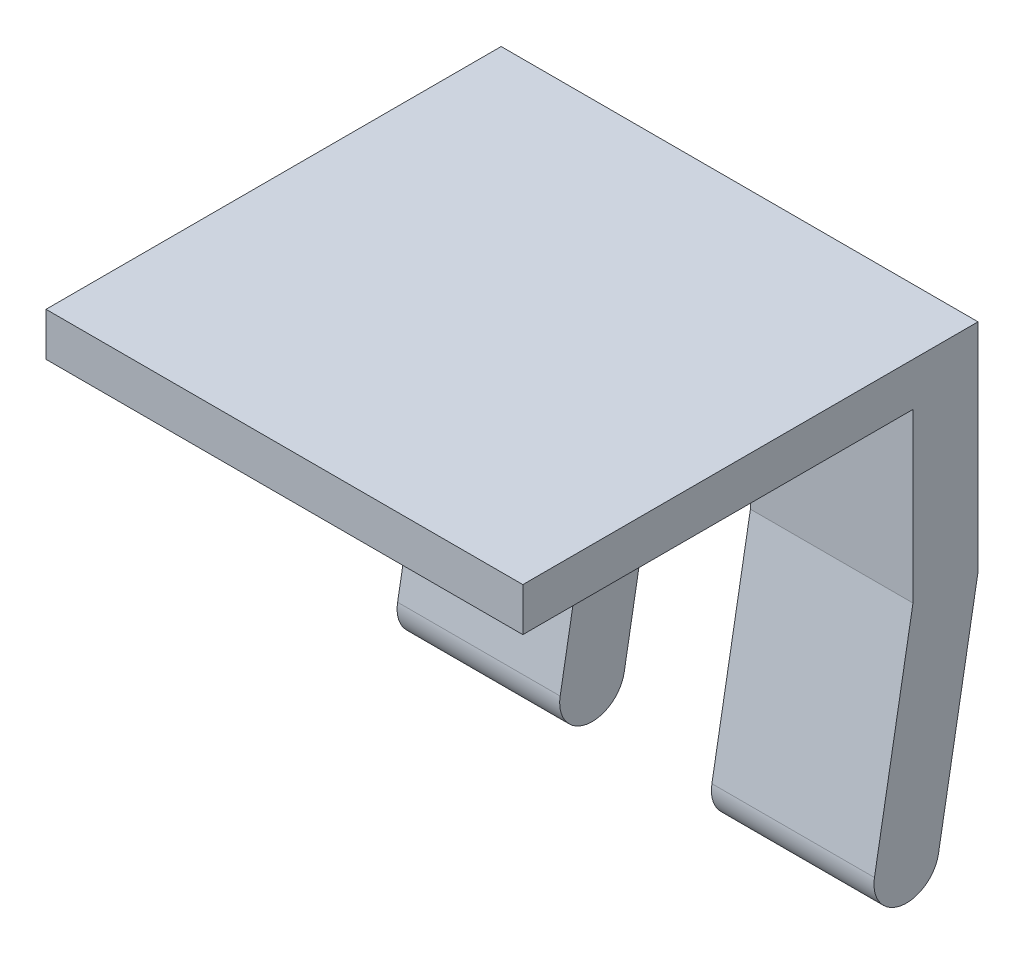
ISO-10303-21;
HEADER;
FILE_DESCRIPTION(('STEP AP214'),'2;1');
FILE_NAME('part.step','',(''),(''),'','','');
FILE_SCHEMA(('AUTOMOTIVE_DESIGN { 1 0 10303 214 1 1 1 1 }'));
ENDSEC;
DATA;
#1=APPLICATION_CONTEXT('core data for automotive mechanical design processes');
#2=APPLICATION_PROTOCOL_DEFINITION('international standard','automotive_design',2000,#1);
#3=PRODUCT_CONTEXT('',#1,'mechanical');
#4=PRODUCT('Part','Part','',(#3));
#5=PRODUCT_RELATED_PRODUCT_CATEGORY('part','',(#4));
#6=PRODUCT_DEFINITION_FORMATION('','',#4);
#7=PRODUCT_DEFINITION_CONTEXT('part definition',#1,'design');
#8=PRODUCT_DEFINITION('design','',#6,#7);
#9=PRODUCT_DEFINITION_SHAPE('','',#8);
#10=(LENGTH_UNIT() NAMED_UNIT(*) SI_UNIT(.MILLI.,.METRE.));
#11=(NAMED_UNIT(*) PLANE_ANGLE_UNIT() SI_UNIT($,.RADIAN.));
#12=(NAMED_UNIT(*) SI_UNIT($,.STERADIAN.) SOLID_ANGLE_UNIT());
#13=UNCERTAINTY_MEASURE_WITH_UNIT(LENGTH_MEASURE(1.E-05),#10,'distance_accuracy_value','');
#14=(GEOMETRIC_REPRESENTATION_CONTEXT(3) GLOBAL_UNCERTAINTY_ASSIGNED_CONTEXT((#13)) GLOBAL_UNIT_ASSIGNED_CONTEXT((#10,
#11,#12)) REPRESENTATION_CONTEXT('',''));
#15=CARTESIAN_POINT('',(0.,0.,0.));
#16=DIRECTION('',(0.,0.,1.));
#17=DIRECTION('',(1.,0.,0.));
#18=AXIS2_PLACEMENT_3D('',#15,#16,#17);
#19=CARTESIAN_POINT('',(3.49999999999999,-1.57707428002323,3.5));
#20=DIRECTION('',(1.,0.,0.));
#21=DIRECTION('',(0.,0.,-1.));
#22=AXIS2_PLACEMENT_3D('',#19,#20,#21);
#23=CYLINDRICAL_SURFACE('',#22,1.5);
#24=CARTESIAN_POINT('',(3.49999999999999,-1.57707428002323,3.5));
#25=DIRECTION('',(1.,0.,0.));
#26=DIRECTION('',(0.,0.,-1.));
#27=AXIS2_PLACEMENT_3D('',#24,#25,#26);
#28=CIRCLE('',#27,1.5);
#29=CARTESIAN_POINT('',(3.5,-1.83754654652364,2.02278837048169));
#30=VERTEX_POINT('',#29);
#31=CARTESIAN_POINT('',(3.5,-1.31660201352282,4.97721162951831));
#32=VERTEX_POINT('',#31);
#33=EDGE_CURVE('E19',#30,#32,#28,.F.);
#34=ORIENTED_EDGE('',*,*,#33,.F.);
#35=DIRECTION('',(1.,0.,0.));
#36=VECTOR('',#35,1.);
#37=CARTESIAN_POINT('',(3.5,-1.83754654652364,2.02278837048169));
#38=LINE('',#37,#36);
#39=CARTESIAN_POINT('',(11.,-1.83754654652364,2.02278837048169));
#40=VERTEX_POINT('',#39);
#41=EDGE_CURVE('E113',#40,#30,#38,.F.);
#42=ORIENTED_EDGE('',*,*,#41,.F.);
#43=CARTESIAN_POINT('',(11.,-1.57707428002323,3.5));
#44=DIRECTION('',(1.,0.,0.));
#45=DIRECTION('',(0.,0.,-1.));
#46=AXIS2_PLACEMENT_3D('',#43,#44,#45);
#47=CIRCLE('',#46,1.5);
#48=CARTESIAN_POINT('',(11.,-1.31660201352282,4.97721162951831));
#49=VERTEX_POINT('',#48);
#50=EDGE_CURVE('E186',#40,#49,#47,.F.);
#51=ORIENTED_EDGE('',*,*,#50,.T.);
#52=DIRECTION('',(1.,0.,0.));
#53=VECTOR('',#52,1.);
#54=CARTESIAN_POINT('',(3.49999999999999,-1.31660201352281,4.97721162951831));
#55=LINE('',#54,#53);
#56=EDGE_CURVE('E129',#32,#49,#55,.T.);
#57=ORIENTED_EDGE('',*,*,#56,.F.);
#58=EDGE_LOOP('',(#34,#42,#51,#57));
#59=FACE_BOUND('',#58,.T.);
#60=ADVANCED_FACE('F15',(#59),#23,.T.);
#61=CARTESIAN_POINT('',(3.49999999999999,-1.31660201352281,4.97721162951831));
#62=DIRECTION('',(0.,0.173648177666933,0.984807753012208));
#63=DIRECTION('',(0.,-0.984807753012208,0.173648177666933));
#64=AXIS2_PLACEMENT_3D('',#61,#62,#63);
#65=PLANE('',#64);
#66=DIRECTION('',(0.,0.984807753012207,-0.173648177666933));
#67=VECTOR('',#66,1.);
#68=CARTESIAN_POINT('',(3.5,-1.31660201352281,4.97721162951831));
#69=LINE('',#68,#67);
#70=CARTESIAN_POINT('',(3.5,8.76246599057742,3.19999999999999));
#71=VERTEX_POINT('',#70);
#72=EDGE_CURVE('E123',#32,#71,#69,.T.);
#73=ORIENTED_EDGE('',*,*,#72,.F.);
#74=ORIENTED_EDGE('',*,*,#56,.T.);
#75=DIRECTION('',(0.,0.984807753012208,-0.173648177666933));
#76=VECTOR('',#75,1.);
#77=CARTESIAN_POINT('',(11.,-1.31660201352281,4.97721162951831));
#78=LINE('',#77,#76);
#79=CARTESIAN_POINT('',(11.,8.7624659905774,3.19999999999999));
#80=VERTEX_POINT('',#79);
#81=EDGE_CURVE('E161',#49,#80,#78,.T.);
#82=ORIENTED_EDGE('',*,*,#81,.T.);
#83=DIRECTION('',(1.,0.,0.));
#84=VECTOR('',#83,1.);
#85=CARTESIAN_POINT('',(3.5,8.76246599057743,3.19999999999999));
#86=LINE('',#85,#84);
#87=EDGE_CURVE('E124',#71,#80,#86,.T.);
#88=ORIENTED_EDGE('',*,*,#87,.F.);
#89=EDGE_LOOP('',(#73,#74,#82,#88));
#90=FACE_BOUND('',#89,.T.);
#91=ADVANCED_FACE('F293',(#90),#65,.T.);
#92=CARTESIAN_POINT('',(3.5,8.76246599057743,3.19999999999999));
#93=DIRECTION('',(0.,0.,1.));
#94=DIRECTION('',(1.,0.,0.));
#95=AXIS2_PLACEMENT_3D('',#92,#93,#94);
#96=PLANE('',#95);
#97=DIRECTION('',(0.,1.,0.));
#98=VECTOR('',#97,1.);
#99=CARTESIAN_POINT('',(3.5,6.29343307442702,3.19999999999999));
#100=LINE('',#99,#98);
#101=CARTESIAN_POINT('',(3.5,16.5000000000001,3.19999999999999));
#102=VERTEX_POINT('',#101);
#103=EDGE_CURVE('E138',#71,#102,#100,.T.);
#104=ORIENTED_EDGE('',*,*,#103,.F.);
#105=ORIENTED_EDGE('',*,*,#87,.T.);
#106=DIRECTION('',(0.,1.,0.));
#107=VECTOR('',#106,1.);
#108=CARTESIAN_POINT('',(11.,16.5,3.19999999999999));
#109=LINE('',#108,#107);
#110=CARTESIAN_POINT('',(11.,16.5000000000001,3.19999999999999));
#111=VERTEX_POINT('',#110);
#112=EDGE_CURVE('E160',#80,#111,#109,.T.);
#113=ORIENTED_EDGE('',*,*,#112,.T.);
#114=DIRECTION('',(1.,0.,0.));
#115=VECTOR('',#114,1.);
#116=CARTESIAN_POINT('',(-11.,16.5000000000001,3.19999999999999));
#117=LINE('',#116,#115);
#118=EDGE_CURVE('E163',#102,#111,#117,.T.);
#119=ORIENTED_EDGE('',*,*,#118,.F.);
#120=EDGE_LOOP('',(#104,#105,#113,#119));
#121=FACE_BOUND('',#120,.T.);
#122=ADVANCED_FACE('F290',(#121),#96,.T.);
#123=CARTESIAN_POINT('',(3.5,8.5,0.199999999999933));
#124=DIRECTION('',(0.,-0.173648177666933,-0.984807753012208));
#125=DIRECTION('',(0.,0.984807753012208,-0.173648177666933));
#126=AXIS2_PLACEMENT_3D('',#123,#124,#125);
#127=PLANE('',#126);
#128=DIRECTION('',(0.,-0.984807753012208,0.173648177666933));
#129=VECTOR('',#128,1.);
#130=CARTESIAN_POINT('',(3.5,8.5,0.199999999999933));
#131=LINE('',#130,#129);
#132=CARTESIAN_POINT('',(3.5,8.50000000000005,0.199999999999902));
#133=VERTEX_POINT('',#132);
#134=EDGE_CURVE('E118',#133,#30,#131,.T.);
#135=ORIENTED_EDGE('',*,*,#134,.F.);
#136=DIRECTION('',(-1.,0.,0.));
#137=VECTOR('',#136,1.);
#138=CARTESIAN_POINT('',(-11.,8.5,0.199999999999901));
#139=LINE('',#138,#137);
#140=CARTESIAN_POINT('',(11.,8.50000000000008,0.1999999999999));
#141=VERTEX_POINT('',#140);
#142=EDGE_CURVE('E146',#141,#133,#139,.T.);
#143=ORIENTED_EDGE('',*,*,#142,.F.);
#144=DIRECTION('',(0.,-0.984807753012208,0.173648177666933));
#145=VECTOR('',#144,1.);
#146=CARTESIAN_POINT('',(11.,8.5,0.199999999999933));
#147=LINE('',#146,#145);
#148=EDGE_CURVE('E120',#141,#40,#147,.T.);
#149=ORIENTED_EDGE('',*,*,#148,.T.);
#150=ORIENTED_EDGE('',*,*,#41,.T.);
#151=EDGE_LOOP('',(#135,#143,#149,#150));
#152=FACE_BOUND('',#151,.T.);
#153=ADVANCED_FACE('F115',(#152),#127,.T.);
#154=CARTESIAN_POINT('',(3.5,6.29343307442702,2.50863889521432));
#155=DIRECTION('',(-1.,0.,0.));
#156=DIRECTION('',(0.,0.,1.));
#157=AXIS2_PLACEMENT_3D('',#154,#155,#156);
#158=PLANE('',#157);
#159=ORIENTED_EDGE('',*,*,#134,.T.);
#160=ORIENTED_EDGE('',*,*,#33,.T.);
#161=ORIENTED_EDGE('',*,*,#72,.T.);
#162=ORIENTED_EDGE('',*,*,#103,.T.);
#163=DIRECTION('',(0.,0.,-1.));
#164=VECTOR('',#163,1.);
#165=CARTESIAN_POINT('',(3.5,16.5000000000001,0.199999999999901));
#166=LINE('',#165,#164);
#167=CARTESIAN_POINT('',(3.5,16.5000000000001,0.199999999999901));
#168=VERTEX_POINT('',#167);
#169=EDGE_CURVE('E214',#168,#102,#166,.F.);
#170=ORIENTED_EDGE('',*,*,#169,.F.);
#171=DIRECTION('',(0.,1.,0.));
#172=VECTOR('',#171,1.);
#173=CARTESIAN_POINT('',(3.5,18.5,0.199999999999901));
#174=LINE('',#173,#172);
#175=EDGE_CURVE('E136',#133,#168,#174,.T.);
#176=ORIENTED_EDGE('',*,*,#175,.F.);
#177=EDGE_LOOP('',(#159,#160,#161,#162,#170,#176));
#178=FACE_BOUND('',#177,.T.);
#179=ADVANCED_FACE('F134',(#178),#158,.T.);
#180=CARTESIAN_POINT('',(-3.49999999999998,16.5000000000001,0.199999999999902));
#181=DIRECTION('',(1.,0.,0.));
#182=DIRECTION('',(0.,0.,1.));
#183=AXIS2_PLACEMENT_3D('',#180,#181,#182);
#184=PLANE('',#183);
#185=DIRECTION('',(0.,0.,-1.));
#186=VECTOR('',#185,1.);
#187=CARTESIAN_POINT('',(-3.49999999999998,16.5000000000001,0.199999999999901));
#188=LINE('',#187,#186);
#189=CARTESIAN_POINT('',(-3.49999999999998,16.5000000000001,3.19999999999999));
#190=VERTEX_POINT('',#189);
#191=CARTESIAN_POINT('',(-3.49999999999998,16.5000000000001,0.199999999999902));
#192=VERTEX_POINT('',#191);
#193=EDGE_CURVE('E170',#190,#192,#188,.T.);
#194=ORIENTED_EDGE('',*,*,#193,.F.);
#195=DIRECTION('',(0.,1.,0.));
#196=VECTOR('',#195,1.);
#197=CARTESIAN_POINT('',(-3.49999999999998,12.6312329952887,3.19999999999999));
#198=LINE('',#197,#196);
#199=CARTESIAN_POINT('',(-3.49999999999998,8.76246599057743,3.19999999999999));
#200=VERTEX_POINT('',#199);
#201=EDGE_CURVE('E167',#200,#190,#198,.T.);
#202=ORIENTED_EDGE('',*,*,#201,.F.);
#203=DIRECTION('',(0.,0.984807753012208,-0.173648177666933));
#204=VECTOR('',#203,1.);
#205=CARTESIAN_POINT('',(-3.49999999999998,3.72293198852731,4.08860581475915));
#206=LINE('',#205,#204);
#207=CARTESIAN_POINT('',(-3.49999999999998,-1.31660201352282,4.97721162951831));
#208=VERTEX_POINT('',#207);
#209=EDGE_CURVE('E178',#208,#200,#206,.T.);
#210=ORIENTED_EDGE('',*,*,#209,.F.);
#211=CARTESIAN_POINT('',(-3.49999999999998,-1.57707428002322,3.5));
#212=DIRECTION('',(-1.,0.,0.));
#213=DIRECTION('',(0.,0.,1.));
#214=AXIS2_PLACEMENT_3D('',#211,#212,#213);
#215=CIRCLE('',#214,1.5);
#216=CARTESIAN_POINT('',(-3.49999999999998,-1.83754654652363,2.02278837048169));
#217=VERTEX_POINT('',#216);
#218=EDGE_CURVE('E187',#217,#208,#215,.T.);
#219=ORIENTED_EDGE('',*,*,#218,.F.);
#220=DIRECTION('',(0.,-0.984807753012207,0.173648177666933));
#221=VECTOR('',#220,1.);
#222=CARTESIAN_POINT('',(-3.49999999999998,3.33122672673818,1.11139418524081));
#223=LINE('',#222,#221);
#224=CARTESIAN_POINT('',(-3.49999999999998,8.5,0.199999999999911));
#225=VERTEX_POINT('',#224);
#226=EDGE_CURVE('E133',#225,#217,#223,.T.);
#227=ORIENTED_EDGE('',*,*,#226,.F.);
#228=DIRECTION('',(0.,1.,0.));
#229=VECTOR('',#228,1.);
#230=CARTESIAN_POINT('',(-3.49999999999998,18.5,0.199999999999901));
#231=LINE('',#230,#229);
#232=EDGE_CURVE('E204',#192,#225,#231,.F.);
#233=ORIENTED_EDGE('',*,*,#232,.F.);
#234=EDGE_LOOP('',(#194,#202,#210,#219,#227,#233));
#235=FACE_BOUND('',#234,.T.);
#236=ADVANCED_FACE('F260',(#235),#184,.T.);
#237=CARTESIAN_POINT('',(-3.49999999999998,8.50000000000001,0.19999999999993));
#238=DIRECTION('',(0.,-0.173648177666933,-0.984807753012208));
#239=DIRECTION('',(0.,-0.984807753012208,0.173648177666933));
#240=AXIS2_PLACEMENT_3D('',#237,#238,#239);
#241=PLANE('',#240);
#242=ORIENTED_EDGE('',*,*,#226,.T.);
#243=DIRECTION('',(1.,0.,0.));
#244=VECTOR('',#243,1.);
#245=CARTESIAN_POINT('',(-7.24999999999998,-1.83754654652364,2.02278837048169));
#246=LINE('',#245,#244);
#247=CARTESIAN_POINT('',(-11.,-1.83754654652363,2.02278837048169));
#248=VERTEX_POINT('',#247);
#249=EDGE_CURVE('E188',#248,#217,#246,.T.);
#250=ORIENTED_EDGE('',*,*,#249,.F.);
#251=DIRECTION('',(0.,-0.984807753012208,0.173648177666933));
#252=VECTOR('',#251,1.);
#253=CARTESIAN_POINT('',(-11.,8.5,0.199999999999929));
#254=LINE('',#253,#252);
#255=CARTESIAN_POINT('',(-11.,8.50000000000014,0.1999999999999));
#256=VERTEX_POINT('',#255);
#257=EDGE_CURVE('E185',#256,#248,#254,.T.);
#258=ORIENTED_EDGE('',*,*,#257,.F.);
#259=DIRECTION('',(-1.,0.,0.));
#260=VECTOR('',#259,1.);
#261=CARTESIAN_POINT('',(-11.,8.5,0.199999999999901));
#262=LINE('',#261,#260);
#263=EDGE_CURVE('E176',#225,#256,#262,.T.);
#264=ORIENTED_EDGE('',*,*,#263,.F.);
#265=EDGE_LOOP('',(#242,#250,#258,#264));
#266=FACE_BOUND('',#265,.T.);
#267=ADVANCED_FACE('F236',(#266),#241,.T.);
#268=CARTESIAN_POINT('',(-3.49999999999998,-1.57707428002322,3.5));
#269=DIRECTION('',(-1.,0.,0.));
#270=DIRECTION('',(0.,0.,1.));
#271=AXIS2_PLACEMENT_3D('',#268,#269,#270);
#272=CYLINDRICAL_SURFACE('',#271,1.5);
#273=ORIENTED_EDGE('',*,*,#218,.T.);
#274=DIRECTION('',(1.,0.,0.));
#275=VECTOR('',#274,1.);
#276=CARTESIAN_POINT('',(-7.24999999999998,-1.31660201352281,4.97721162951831));
#277=LINE('',#276,#275);
#278=CARTESIAN_POINT('',(-11.,-1.31660201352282,4.97721162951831));
#279=VERTEX_POINT('',#278);
#280=EDGE_CURVE('E180',#279,#208,#277,.T.);
#281=ORIENTED_EDGE('',*,*,#280,.F.);
#282=CARTESIAN_POINT('',(-11.,-1.57707428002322,3.5));
#283=DIRECTION('',(-1.,0.,0.));
#284=DIRECTION('',(0.,0.,1.));
#285=AXIS2_PLACEMENT_3D('',#282,#283,#284);
#286=CIRCLE('',#285,1.5);
#287=EDGE_CURVE('E181',#248,#279,#286,.T.);
#288=ORIENTED_EDGE('',*,*,#287,.F.);
#289=ORIENTED_EDGE('',*,*,#249,.T.);
#290=EDGE_LOOP('',(#273,#281,#288,#289));
#291=FACE_BOUND('',#290,.T.);
#292=ADVANCED_FACE('F237',(#291),#272,.T.);
#293=CARTESIAN_POINT('',(-3.49999999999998,-1.31660201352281,4.97721162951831));
#294=DIRECTION('',(0.,0.173648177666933,0.984807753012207));
#295=DIRECTION('',(0.,0.984807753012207,-0.173648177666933));
#296=AXIS2_PLACEMENT_3D('',#293,#294,#295);
#297=PLANE('',#296);
#298=ORIENTED_EDGE('',*,*,#209,.T.);
#299=DIRECTION('',(1.,0.,0.));
#300=VECTOR('',#299,1.);
#301=CARTESIAN_POINT('',(-7.24999999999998,8.76246599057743,3.19999999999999));
#302=LINE('',#301,#300);
#303=CARTESIAN_POINT('',(-11.,8.7624659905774,3.19999999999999));
#304=VERTEX_POINT('',#303);
#305=EDGE_CURVE('E172',#304,#200,#302,.T.);
#306=ORIENTED_EDGE('',*,*,#305,.F.);
#307=DIRECTION('',(0.,0.984807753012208,-0.173648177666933));
#308=VECTOR('',#307,1.);
#309=CARTESIAN_POINT('',(-11.,-1.31660201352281,4.97721162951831));
#310=LINE('',#309,#308);
#311=EDGE_CURVE('E184',#279,#304,#310,.T.);
#312=ORIENTED_EDGE('',*,*,#311,.F.);
#313=ORIENTED_EDGE('',*,*,#280,.T.);
#314=EDGE_LOOP('',(#298,#306,#312,#313));
#315=FACE_BOUND('',#314,.T.);
#316=ADVANCED_FACE('F239',(#315),#297,.T.);
#317=CARTESIAN_POINT('',(-3.49999999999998,8.76246599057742,3.19999999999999));
#318=DIRECTION('',(0.,0.,1.));
#319=DIRECTION('',(0.,1.,0.));
#320=AXIS2_PLACEMENT_3D('',#317,#318,#319);
#321=PLANE('',#320);
#322=ORIENTED_EDGE('',*,*,#201,.T.);
#323=DIRECTION('',(1.,0.,0.));
#324=VECTOR('',#323,1.);
#325=CARTESIAN_POINT('',(-11.,16.5000000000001,3.19999999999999));
#326=LINE('',#325,#324);
#327=CARTESIAN_POINT('',(-11.,16.5,3.19999999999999));
#328=VERTEX_POINT('',#327);
#329=EDGE_CURVE('E166',#328,#190,#326,.T.);
#330=ORIENTED_EDGE('',*,*,#329,.F.);
#331=DIRECTION('',(0.,1.,0.));
#332=VECTOR('',#331,1.);
#333=CARTESIAN_POINT('',(-11.,17.5,3.19999999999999));
#334=LINE('',#333,#332);
#335=EDGE_CURVE('E221',#304,#328,#334,.T.);
#336=ORIENTED_EDGE('',*,*,#335,.F.);
#337=ORIENTED_EDGE('',*,*,#305,.T.);
#338=EDGE_LOOP('',(#322,#330,#336,#337));
#339=FACE_BOUND('',#338,.T.);
#340=ADVANCED_FACE('F17',(#339),#321,.T.);
#341=CARTESIAN_POINT('',(-11.,16.5000000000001,0.199999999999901));
#342=DIRECTION('',(0.,-1.,0.));
#343=DIRECTION('',(0.,0.,-1.));
#344=AXIS2_PLACEMENT_3D('',#341,#342,#343);
#345=PLANE('',#344);
#346=DIRECTION('',(-1.,0.,0.));
#347=VECTOR('',#346,1.);
#348=CARTESIAN_POINT('',(-11.,16.5000000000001,0.199999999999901));
#349=LINE('',#348,#347);
#350=EDGE_CURVE('E211',#168,#192,#349,.T.);
#351=ORIENTED_EDGE('',*,*,#350,.F.);
#352=ORIENTED_EDGE('',*,*,#169,.T.);
#353=ORIENTED_EDGE('',*,*,#118,.T.);
#354=DIRECTION('',(0.,0.,1.));
#355=VECTOR('',#354,1.);
#356=CARTESIAN_POINT('',(11.,16.5000000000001,21.1999999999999));
#357=LINE('',#356,#355);
#358=CARTESIAN_POINT('',(11.,16.5,21.1999999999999));
#359=VERTEX_POINT('',#358);
#360=EDGE_CURVE('E151',#111,#359,#357,.T.);
#361=ORIENTED_EDGE('',*,*,#360,.T.);
#362=DIRECTION('',(1.,0.,0.));
#363=VECTOR('',#362,1.);
#364=CARTESIAN_POINT('',(-11.,16.5,21.1999999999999));
#365=LINE('',#364,#363);
#366=CARTESIAN_POINT('',(-11.,16.5,21.1999999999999));
#367=VERTEX_POINT('',#366);
#368=EDGE_CURVE('E156',#367,#359,#365,.T.);
#369=ORIENTED_EDGE('',*,*,#368,.F.);
#370=DIRECTION('',(0.,0.,1.));
#371=VECTOR('',#370,1.);
#372=CARTESIAN_POINT('',(-11.,16.5,10.6305568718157));
#373=LINE('',#372,#371);
#374=EDGE_CURVE('E173',#328,#367,#373,.T.);
#375=ORIENTED_EDGE('',*,*,#374,.F.);
#376=ORIENTED_EDGE('',*,*,#329,.T.);
#377=ORIENTED_EDGE('',*,*,#193,.T.);
#378=EDGE_LOOP('',(#351,#352,#353,#361,#369,#375,#376,#377));
#379=FACE_BOUND('',#378,.T.);
#380=ADVANCED_FACE('F246',(#379),#345,.T.);
#381=CARTESIAN_POINT('',(11.,16.5,21.1999999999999));
#382=DIRECTION('',(-1.,0.,0.));
#383=DIRECTION('',(0.,0.,1.));
#384=AXIS2_PLACEMENT_3D('',#381,#382,#383);
#385=PLANE('',#384);
#386=ORIENTED_EDGE('',*,*,#360,.F.);
#387=ORIENTED_EDGE('',*,*,#112,.F.);
#388=ORIENTED_EDGE('',*,*,#81,.F.);
#389=ORIENTED_EDGE('',*,*,#50,.F.);
#390=ORIENTED_EDGE('',*,*,#148,.F.);
#391=DIRECTION('',(0.,1.,0.));
#392=VECTOR('',#391,1.);
#393=CARTESIAN_POINT('',(11.,18.5,0.199999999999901));
#394=LINE('',#393,#392);
#395=CARTESIAN_POINT('',(11.,18.5,0.199999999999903));
#396=VERTEX_POINT('',#395);
#397=EDGE_CURVE('E148',#396,#141,#394,.F.);
#398=ORIENTED_EDGE('',*,*,#397,.F.);
#399=DIRECTION('',(0.,0.,1.));
#400=VECTOR('',#399,1.);
#401=CARTESIAN_POINT('',(11.,18.5,21.0611137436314));
#402=LINE('',#401,#400);
#403=CARTESIAN_POINT('',(11.,18.5,21.1999999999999));
#404=VERTEX_POINT('',#403);
#405=EDGE_CURVE('E152',#404,#396,#402,.F.);
#406=ORIENTED_EDGE('',*,*,#405,.F.);
#407=DIRECTION('',(0.,1.,0.));
#408=VECTOR('',#407,1.);
#409=CARTESIAN_POINT('',(11.,16.5,21.1999999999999));
#410=LINE('',#409,#408);
#411=EDGE_CURVE('E223',#359,#404,#410,.T.);
#412=ORIENTED_EDGE('',*,*,#411,.F.);
#413=EDGE_LOOP('',(#386,#387,#388,#389,#390,#398,#406,#412));
#414=FACE_BOUND('',#413,.T.);
#415=ADVANCED_FACE('F282',(#414),#385,.F.);
#416=CARTESIAN_POINT('',(-11.,18.5,0.199999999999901));
#417=DIRECTION('',(0.,0.,-1.));
#418=DIRECTION('',(-1.,0.,0.));
#419=AXIS2_PLACEMENT_3D('',#416,#417,#418);
#420=PLANE('',#419);
#421=DIRECTION('',(0.,1.,0.));
#422=VECTOR('',#421,1.);
#423=CARTESIAN_POINT('',(-11.,17.5,0.199999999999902));
#424=LINE('',#423,#422);
#425=CARTESIAN_POINT('',(-11.,18.5,0.199999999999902));
#426=VERTEX_POINT('',#425);
#427=EDGE_CURVE('E175',#426,#256,#424,.F.);
#428=ORIENTED_EDGE('',*,*,#427,.F.);
#429=DIRECTION('',(1.,0.,0.));
#430=VECTOR('',#429,1.);
#431=CARTESIAN_POINT('',(-11.,18.5,0.199999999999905));
#432=LINE('',#431,#430);
#433=EDGE_CURVE('E155',#396,#426,#432,.F.);
#434=ORIENTED_EDGE('',*,*,#433,.F.);
#435=ORIENTED_EDGE('',*,*,#397,.T.);
#436=ORIENTED_EDGE('',*,*,#142,.T.);
#437=ORIENTED_EDGE('',*,*,#175,.T.);
#438=ORIENTED_EDGE('',*,*,#350,.T.);
#439=ORIENTED_EDGE('',*,*,#232,.T.);
#440=ORIENTED_EDGE('',*,*,#263,.T.);
#441=EDGE_LOOP('',(#428,#434,#435,#436,#437,#438,#439,#440));
#442=FACE_BOUND('',#441,.T.);
#443=ADVANCED_FACE('F257',(#442),#420,.T.);
#444=CARTESIAN_POINT('',(-11.,17.5,10.6305568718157));
#445=DIRECTION('',(-1.,0.,0.));
#446=DIRECTION('',(0.,0.,1.));
#447=AXIS2_PLACEMENT_3D('',#444,#445,#446);
#448=PLANE('',#447);
#449=ORIENTED_EDGE('',*,*,#311,.T.);
#450=ORIENTED_EDGE('',*,*,#335,.T.);
#451=ORIENTED_EDGE('',*,*,#374,.T.);
#452=DIRECTION('',(0.,1.,0.));
#453=VECTOR('',#452,1.);
#454=CARTESIAN_POINT('',(-11.,16.5,21.1999999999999));
#455=LINE('',#454,#453);
#456=CARTESIAN_POINT('',(-11.,18.5,21.1999999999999));
#457=VERTEX_POINT('',#456);
#458=EDGE_CURVE('E34',#457,#367,#455,.F.);
#459=ORIENTED_EDGE('',*,*,#458,.F.);
#460=DIRECTION('',(0.,0.,1.));
#461=VECTOR('',#460,1.);
#462=CARTESIAN_POINT('',(-11.,18.5,21.0611137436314));
#463=LINE('',#462,#461);
#464=EDGE_CURVE('E25',#426,#457,#463,.T.);
#465=ORIENTED_EDGE('',*,*,#464,.F.);
#466=ORIENTED_EDGE('',*,*,#427,.T.);
#467=ORIENTED_EDGE('',*,*,#257,.T.);
#468=ORIENTED_EDGE('',*,*,#287,.T.);
#469=EDGE_LOOP('',(#449,#450,#451,#459,#465,#466,#467,#468));
#470=FACE_BOUND('',#469,.T.);
#471=ADVANCED_FACE('F233',(#470),#448,.T.);
#472=CARTESIAN_POINT('',(-11.,16.5,21.1999999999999));
#473=DIRECTION('',(0.,0.,1.));
#474=DIRECTION('',(1.,0.,0.));
#475=AXIS2_PLACEMENT_3D('',#472,#473,#474);
#476=PLANE('',#475);
#477=ORIENTED_EDGE('',*,*,#458,.T.);
#478=ORIENTED_EDGE('',*,*,#368,.T.);
#479=ORIENTED_EDGE('',*,*,#411,.T.);
#480=DIRECTION('',(1.,0.,0.));
#481=VECTOR('',#480,1.);
#482=CARTESIAN_POINT('',(-11.,18.5,21.1999999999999));
#483=LINE('',#482,#481);
#484=EDGE_CURVE('E10',#457,#404,#483,.T.);
#485=ORIENTED_EDGE('',*,*,#484,.F.);
#486=EDGE_LOOP('',(#477,#478,#479,#485));
#487=FACE_BOUND('',#486,.T.);
#488=ADVANCED_FACE('F252',(#487),#476,.T.);
#489=CARTESIAN_POINT('',(-11.,18.5,21.0611137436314));
#490=DIRECTION('',(0.,1.,0.));
#491=DIRECTION('',(0.,0.,1.));
#492=AXIS2_PLACEMENT_3D('',#489,#490,#491);
#493=PLANE('',#492);
#494=ORIENTED_EDGE('',*,*,#464,.T.);
#495=ORIENTED_EDGE('',*,*,#484,.T.);
#496=ORIENTED_EDGE('',*,*,#405,.T.);
#497=ORIENTED_EDGE('',*,*,#433,.T.);
#498=EDGE_LOOP('',(#494,#495,#496,#497));
#499=FACE_BOUND('',#498,.T.);
#500=ADVANCED_FACE('F254',(#499),#493,.T.);
#501=CLOSED_SHELL('',(#60,#91,#122,#153,#179,#236,#267,#292,#316,#340,#380,#415,#443,#471,#488,#500));
#502=MANIFOLD_SOLID_BREP('B1',#501);
#503=ADVANCED_BREP_SHAPE_REPRESENTATION('',(#18,#502),#14);
#504=SHAPE_DEFINITION_REPRESENTATION(#9,#503);
ENDSEC;
END-ISO-10303-21;
